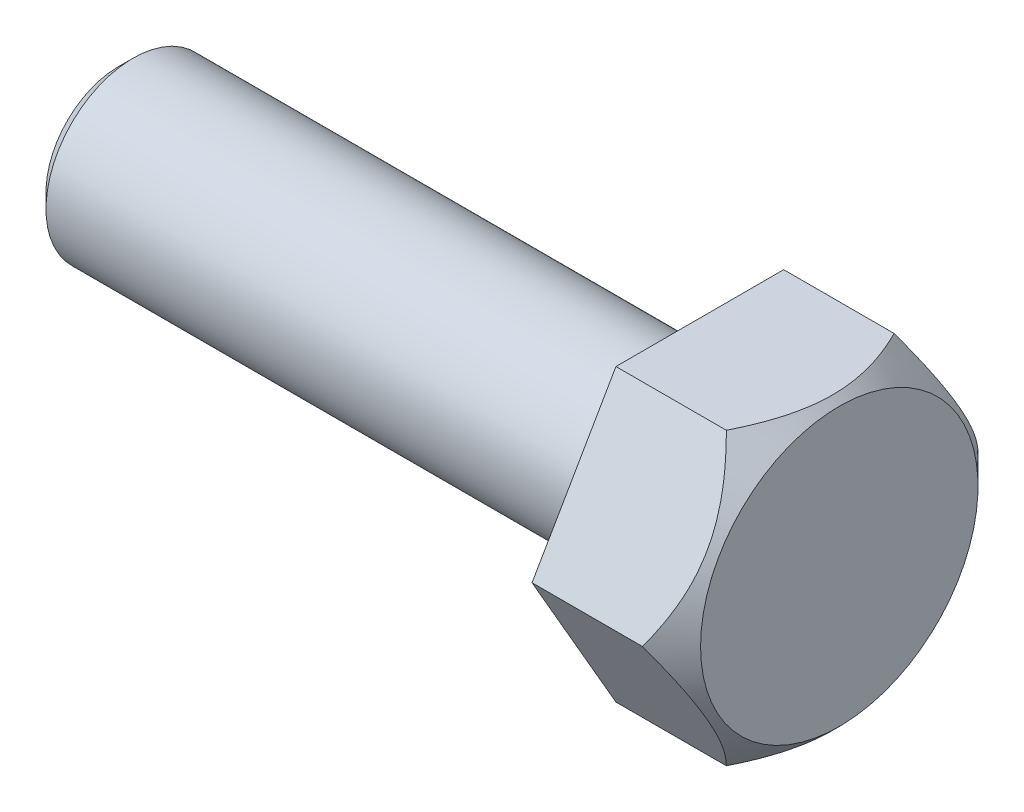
ISO-10303-21;
HEADER;
FILE_DESCRIPTION(('STEP AP214'),'2;1');
FILE_NAME('part.step','',(''),(''),'','','');
FILE_SCHEMA(('AUTOMOTIVE_DESIGN { 1 0 10303 214 1 1 1 1 }'));
ENDSEC;
DATA;
#1=APPLICATION_CONTEXT('core data for automotive mechanical design processes');
#2=APPLICATION_PROTOCOL_DEFINITION('international standard','automotive_design',2000,#1);
#3=PRODUCT_CONTEXT('',#1,'mechanical');
#4=PRODUCT('Part','Part','',(#3));
#5=PRODUCT_RELATED_PRODUCT_CATEGORY('part','',(#4));
#6=PRODUCT_DEFINITION_FORMATION('','',#4);
#7=PRODUCT_DEFINITION_CONTEXT('part definition',#1,'design');
#8=PRODUCT_DEFINITION('design','',#6,#7);
#9=PRODUCT_DEFINITION_SHAPE('','',#8);
#10=(LENGTH_UNIT() NAMED_UNIT(*) SI_UNIT(.MILLI.,.METRE.));
#11=(NAMED_UNIT(*) PLANE_ANGLE_UNIT() SI_UNIT($,.RADIAN.));
#12=(NAMED_UNIT(*) SI_UNIT($,.STERADIAN.) SOLID_ANGLE_UNIT());
#13=UNCERTAINTY_MEASURE_WITH_UNIT(LENGTH_MEASURE(1.E-05),#10,'distance_accuracy_value','');
#14=(GEOMETRIC_REPRESENTATION_CONTEXT(3) GLOBAL_UNCERTAINTY_ASSIGNED_CONTEXT((#13)) GLOBAL_UNIT_ASSIGNED_CONTEXT((#10,
#11,#12)) REPRESENTATION_CONTEXT('',''));
#15=CARTESIAN_POINT('',(0.,0.,0.));
#16=DIRECTION('',(0.,0.,1.));
#17=DIRECTION('',(1.,0.,0.));
#18=AXIS2_PLACEMENT_3D('',#15,#16,#17);
#19=CARTESIAN_POINT('',(4.80000000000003,4.99999999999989,2.88675134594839));
#20=DIRECTION('',(0.,-0.500000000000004,-0.866025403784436));
#21=DIRECTION('',(0.,0.866025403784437,-0.500000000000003));
#22=AXIS2_PLACEMENT_3D('',#19,#20,#21);
#23=PLANE('',#22);
#24=CARTESIAN_POINT('',(3.79988452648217,5.00019999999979,2.88663587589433));
#25=CARTESIAN_POINT('',(3.84951645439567,4.91422723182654,2.93627227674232));
#26=CARTESIAN_POINT('',(3.89762527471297,4.82759363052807,2.98629020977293));
#27=CARTESIAN_POINT('',(3.99033336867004,4.65287511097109,3.08716399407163));
#28=CARTESIAN_POINT('',(4.03493072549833,4.56478943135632,3.13802028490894));
#29=CARTESIAN_POINT('',(4.16314092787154,4.29734143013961,3.29243146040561));
#30=CARTESIAN_POINT('',(4.24062493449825,4.11571500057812,3.39729352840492));
#31=CARTESIAN_POINT('',(4.37331105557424,3.74945075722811,3.60875628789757));
#32=CARTESIAN_POINT('',(4.42884745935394,3.56490656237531,3.71530292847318));
#33=CARTESIAN_POINT('',(4.49308950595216,3.28505622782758,3.87687459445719));
#34=CARTESIAN_POINT('',(4.51131783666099,3.19136076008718,3.930969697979));
#35=CARTESIAN_POINT('',(4.54100781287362,3.00317647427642,4.03961794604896));
#36=CARTESIAN_POINT('',(4.55247046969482,2.90868777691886,4.09417102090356));
#37=CARTESIAN_POINT('',(4.57168913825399,2.67843374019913,4.2271082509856));
#38=CARTESIAN_POINT('',(4.57572171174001,2.54242031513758,4.30563563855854));
#39=CARTESIAN_POINT('',(4.56895414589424,2.27063858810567,4.46254889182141));
#40=CARTESIAN_POINT('',(4.55814880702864,2.13487038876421,4.54093469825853));
#41=CARTESIAN_POINT('',(4.52234235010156,1.86461396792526,4.69696731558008));
#42=CARTESIAN_POINT('',(4.49732535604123,1.73012734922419,4.77461320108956));
#43=CARTESIAN_POINT('',(4.43445567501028,1.46346560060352,4.92857043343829));
#44=CARTESIAN_POINT('',(4.39660397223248,1.33129029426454,5.00488188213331));
#45=CARTESIAN_POINT('',(4.31873011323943,1.09665179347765,5.14035048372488));
#46=CARTESIAN_POINT('',(4.28075574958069,0.993669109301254,5.199807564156));
#47=CARTESIAN_POINT('',(4.19868737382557,0.789552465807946,5.31765436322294));
#48=CARTESIAN_POINT('',(4.15459317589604,0.688418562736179,5.37604404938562));
#49=CARTESIAN_POINT('',(4.06127361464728,0.488318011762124,5.4915721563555));
#50=CARTESIAN_POINT('',(4.01206438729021,0.389345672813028,5.54871386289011));
#51=CARTESIAN_POINT('',(3.90916087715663,0.193233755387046,5.66193913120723));
#52=CARTESIAN_POINT('',(3.85546934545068,0.0960930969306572,5.71802331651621));
#53=CARTESIAN_POINT('',(3.79988452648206,-0.000200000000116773,5.7736181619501));
#54=B_SPLINE_CURVE_WITH_KNOTS('',3,(#24,#25,#26,#27,#28,#29,#30,#31,#32,#33,#34,#35,#36,#37,#38,
#39,#40,#41,#42,#43,#44,#45,#46,#47,#48,#49,#50,#51,#52,#53),.UNSPECIFIED.,.F.,.F.,(4,2,2,2,2,2,
2,2,2,2,2,2,2,2,4),(0.,0.332945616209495,0.666071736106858,1.3359206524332,1.99513262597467,
2.32409207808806,2.65300234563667,3.12358963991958,3.59434188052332,4.06562104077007,
4.53686407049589,4.9111795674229,5.28550643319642,5.65868635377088,6.0316388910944),.UNSPECIFIED.);
#55=CARTESIAN_POINT('',(3.80000000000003,4.99999999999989,2.88675134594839));
#56=VERTEX_POINT('',#55);
#57=CARTESIAN_POINT('',(3.80000000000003,0.,5.77350269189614));
#58=VERTEX_POINT('',#57);
#59=EDGE_CURVE('E166',#56,#58,#54,.T.);
#60=ORIENTED_EDGE('',*,*,#59,.F.);
#61=DIRECTION('',(-1.,0.,0.));
#62=VECTOR('',#61,1.);
#63=CARTESIAN_POINT('',(4.80000000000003,4.99999999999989,2.88675134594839));
#64=LINE('',#63,#62);
#65=CARTESIAN_POINT('',(0.,4.99999999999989,2.88675134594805));
#66=VERTEX_POINT('',#65);
#67=EDGE_CURVE('E118',#56,#66,#64,.T.);
#68=ORIENTED_EDGE('',*,*,#67,.T.);
#69=DIRECTION('',(0.,-0.866025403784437,0.500000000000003));
#70=VECTOR('',#69,1.);
#71=CARTESIAN_POINT('',(0.,4.99999999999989,2.88675134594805));
#72=LINE('',#71,#70);
#73=CARTESIAN_POINT('',(0.,0.,5.77350269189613));
#74=VERTEX_POINT('',#73);
#75=EDGE_CURVE('E121',#66,#74,#72,.T.);
#76=ORIENTED_EDGE('',*,*,#75,.T.);
#77=DIRECTION('',(-1.,0.,0.));
#78=VECTOR('',#77,1.);
#79=CARTESIAN_POINT('',(4.80000000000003,0.,5.77350269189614));
#80=LINE('',#79,#78);
#81=EDGE_CURVE('E64',#58,#74,#80,.T.);
#82=ORIENTED_EDGE('',*,*,#81,.F.);
#83=EDGE_LOOP('',(#60,#68,#76,#82));
#84=FACE_BOUND('',#83,.T.);
#85=ADVANCED_FACE('F40',(#84),#23,.F.);
#86=CARTESIAN_POINT('',(4.80000000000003,0.,5.77350269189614));
#87=DIRECTION('',(0.,0.499999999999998,-0.866025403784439));
#88=DIRECTION('',(0.,0.86602540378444,0.499999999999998));
#89=AXIS2_PLACEMENT_3D('',#86,#87,#88);
#90=PLANE('',#89);
#91=CARTESIAN_POINT('',(3.79988452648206,0.000199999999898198,5.7736181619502));
#92=CARTESIAN_POINT('',(3.84951645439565,-0.0857727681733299,5.72398176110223));
#93=CARTESIAN_POINT('',(3.897625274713,-0.172406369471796,5.67396382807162));
#94=CARTESIAN_POINT('',(3.99033336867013,-0.347124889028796,5.57309004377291));
#95=CARTESIAN_POINT('',(4.03493072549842,-0.435210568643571,5.52223375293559));
#96=CARTESIAN_POINT('',(4.16314092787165,-0.702658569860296,5.36782257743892));
#97=CARTESIAN_POINT('',(4.24062493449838,-0.884284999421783,5.26296050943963));
#98=CARTESIAN_POINT('',(4.37331105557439,-1.25054924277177,5.05149774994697));
#99=CARTESIAN_POINT('',(4.42884745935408,-1.43509343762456,4.94495110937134));
#100=CARTESIAN_POINT('',(4.4930895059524,-1.71494377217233,4.78337944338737));
#101=CARTESIAN_POINT('',(4.51131783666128,-1.80863923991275,4.72928433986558));
#102=CARTESIAN_POINT('',(4.5410078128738,-1.9968235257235,4.62063609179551));
#103=CARTESIAN_POINT('',(4.55247046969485,-2.09131222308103,4.56608301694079));
#104=CARTESIAN_POINT('',(4.57168913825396,-2.32156625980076,4.43314578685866));
#105=CARTESIAN_POINT('',(4.57572171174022,-2.45757968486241,4.35461839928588));
#106=CARTESIAN_POINT('',(4.56895414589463,-2.72936141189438,4.19770514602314));
#107=CARTESIAN_POINT('',(4.55814880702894,-2.86512961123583,4.11931933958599));
#108=CARTESIAN_POINT('',(4.5223423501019,-3.13538603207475,3.96328672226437));
#109=CARTESIAN_POINT('',(4.49732535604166,-3.26987265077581,3.88564083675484));
#110=CARTESIAN_POINT('',(4.43445567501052,-3.53653439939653,3.73168360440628));
#111=CARTESIAN_POINT('',(4.39660397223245,-3.66870970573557,3.65537215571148));
#112=CARTESIAN_POINT('',(4.31873011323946,-3.90334820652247,3.51990355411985));
#113=CARTESIAN_POINT('',(4.28075574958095,-4.00633089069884,3.46044647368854));
#114=CARTESIAN_POINT('',(4.198687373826,-4.21044753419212,3.34259967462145));
#115=CARTESIAN_POINT('',(4.15459317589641,-4.31158143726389,3.28420998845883));
#116=CARTESIAN_POINT('',(4.06127361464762,-4.51168198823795,3.168681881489));
#117=CARTESIAN_POINT('',(4.0120643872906,-4.61065432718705,3.11154017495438));
#118=CARTESIAN_POINT('',(3.90916087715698,-4.80676624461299,2.99831490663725));
#119=CARTESIAN_POINT('',(3.85546934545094,-4.90390690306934,2.94223072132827));
#120=CARTESIAN_POINT('',(3.79988452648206,-5.00020000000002,2.88663587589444));
#121=B_SPLINE_CURVE_WITH_KNOTS('',3,(#91,#92,#93,#94,#95,#96,#97,#98,#99,#100,#101,#102,#103,
#104,#105,#106,#107,#108,#109,#110,#111,#112,#113,#114,#115,#116,#117,#118,#119,#120),
.UNSPECIFIED.,.F.,.F.,(4,2,2,2,2,2,2,2,2,2,2,2,2,2,4),(0.,0.332945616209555,0.666071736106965,
1.3359206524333,1.99513262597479,2.32409207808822,2.65300234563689,3.12358963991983,
3.59434188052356,4.06562104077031,4.53686407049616,4.91117956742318,5.28550643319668,
5.65868635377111,6.03163889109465),.UNSPECIFIED.);
#122=CARTESIAN_POINT('',(3.80000000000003,-5.00000000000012,2.88675134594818));
#123=VERTEX_POINT('',#122);
#124=EDGE_CURVE('E173',#58,#123,#121,.T.);
#125=ORIENTED_EDGE('',*,*,#124,.F.);
#126=ORIENTED_EDGE('',*,*,#81,.T.);
#127=DIRECTION('',(0.,-0.866025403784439,-0.499999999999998));
#128=VECTOR('',#127,1.);
#129=CARTESIAN_POINT('',(0.,0.,5.77350269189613));
#130=LINE('',#129,#128);
#131=CARTESIAN_POINT('',(0.,-5.00000000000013,2.88675134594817));
#132=VERTEX_POINT('',#131);
#133=EDGE_CURVE('E106',#74,#132,#130,.T.);
#134=ORIENTED_EDGE('',*,*,#133,.T.);
#135=DIRECTION('',(-1.,0.,0.));
#136=VECTOR('',#135,1.);
#137=CARTESIAN_POINT('',(4.80000000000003,-5.00000000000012,2.88675134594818));
#138=LINE('',#137,#136);
#139=EDGE_CURVE('E97',#123,#132,#138,.T.);
#140=ORIENTED_EDGE('',*,*,#139,.F.);
#141=EDGE_LOOP('',(#125,#126,#134,#140));
#142=FACE_BOUND('',#141,.T.);
#143=ADVANCED_FACE('F151',(#142),#90,.F.);
#144=CARTESIAN_POINT('',(4.80000000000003,-5.00000000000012,2.88675134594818));
#145=DIRECTION('',(0.,1.,0.));
#146=DIRECTION('',(0.,0.,1.));
#147=AXIS2_PLACEMENT_3D('',#144,#145,#146);
#148=PLANE('',#147);
#149=CARTESIAN_POINT('',(1.81432336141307,-4.9999999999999,-5.93336867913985));
#150=CARTESIAN_POINT('',(1.92418858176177,-5.00000000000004,-5.78966341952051));
#151=CARTESIAN_POINT('',(2.03304389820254,-5.0000000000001,-5.64517359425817));
#152=CARTESIAN_POINT('',(2.24827641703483,-5.00000000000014,-5.35430787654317));
#153=CARTESIAN_POINT('',(2.35465301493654,-5.00000000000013,-5.20793153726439));
#154=CARTESIAN_POINT('',(2.56522692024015,-5.00000000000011,-4.91190536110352));
#155=CARTESIAN_POINT('',(2.66940102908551,-5.00000000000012,-4.76223896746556));
#156=CARTESIAN_POINT('',(2.87403749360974,-5.00000000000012,-4.4603979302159));
#157=CARTESIAN_POINT('',(2.97450010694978,-5.00000000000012,-4.30822346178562));
#158=CARTESIAN_POINT('',(3.17689028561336,-5.00000000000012,-3.99153933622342));
#159=CARTESIAN_POINT('',(3.27853053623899,-5.00000000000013,-3.82684512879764));
#160=CARTESIAN_POINT('',(3.47537782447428,-5.00000000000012,-3.49359569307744));
#161=CARTESIAN_POINT('',(3.5705838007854,-5.0000000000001,-3.32503983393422));
#162=CARTESIAN_POINT('',(3.75252582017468,-5.00000000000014,-2.98404180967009));
#163=CARTESIAN_POINT('',(3.83928674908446,-5.00000000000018,-2.81161302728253));
#164=CARTESIAN_POINT('',(4.00239520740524,-5.00000000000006,-2.4619377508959));
#165=CARTESIAN_POINT('',(4.07874758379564,-4.99999999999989,-2.28469354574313));
#166=CARTESIAN_POINT('',(4.21181755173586,-4.99999999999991,-1.94171568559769));
#167=CARTESIAN_POINT('',(4.26969922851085,-5.00000000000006,-1.77643834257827));
#168=CARTESIAN_POINT('',(4.37222452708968,-5.00000000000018,-1.44175059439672));
#169=CARTESIAN_POINT('',(4.41686728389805,-5.00000000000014,-1.27233991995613));
#170=CARTESIAN_POINT('',(4.48978435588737,-5.00000000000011,-0.933301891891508));
#171=CARTESIAN_POINT('',(4.51835018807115,-5.00000000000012,-0.763738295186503));
#172=CARTESIAN_POINT('',(4.55853073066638,-5.00000000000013,-0.422603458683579));
#173=CARTESIAN_POINT('',(4.57014874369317,-5.00000000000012,-0.251032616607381));
#174=CARTESIAN_POINT('',(4.57548648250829,-5.00000000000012,0.0853406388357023));
#175=CARTESIAN_POINT('',(4.56992113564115,-5.00000000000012,0.250131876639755));
#176=CARTESIAN_POINT('',(4.54282076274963,-5.00000000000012,0.578387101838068));
#177=CARTESIAN_POINT('',(4.52128424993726,-5.00000000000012,0.741850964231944));
#178=CARTESIAN_POINT('',(4.46307865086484,-5.00000000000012,1.06903592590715));
#179=CARTESIAN_POINT('',(4.42614570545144,-5.00000000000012,1.23270929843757));
#180=CARTESIAN_POINT('',(4.33916921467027,-5.00000000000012,1.55646565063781));
#181=CARTESIAN_POINT('',(4.28912653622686,-5.00000000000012,1.71654886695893));
#182=CARTESIAN_POINT('',(4.17425220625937,-5.00000000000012,2.04376834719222));
#183=CARTESIAN_POINT('',(4.10863700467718,-5.00000000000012,2.2106265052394));
#184=CARTESIAN_POINT('',(3.96728810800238,-5.00000000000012,2.54003854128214));
#185=CARTESIAN_POINT('',(3.89154980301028,-5.00000000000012,2.70259041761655));
#186=CARTESIAN_POINT('',(3.73175240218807,-5.00000000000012,3.02416565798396));
#187=CARTESIAN_POINT('',(3.6476675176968,-5.00000000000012,3.18317610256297));
#188=CARTESIAN_POINT('',(3.47302987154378,-5.00000000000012,3.49754870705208));
#189=CARTESIAN_POINT('',(3.38247811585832,-5.00000000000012,3.65291142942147));
#190=CARTESIAN_POINT('',(3.20078159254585,-5.00000000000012,3.95285892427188));
#191=CARTESIAN_POINT('',(3.10988790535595,-5.00000000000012,4.09759659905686));
#192=CARTESIAN_POINT('',(2.92424528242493,-5.00000000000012,4.38458573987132));
#193=CARTESIAN_POINT('',(2.82949605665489,-5.00000000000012,4.52683701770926));
#194=CARTESIAN_POINT('',(2.63760520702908,-5.00000000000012,4.80803186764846));
#195=CARTESIAN_POINT('',(2.54048901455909,-5.00000000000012,4.94699285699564));
#196=CARTESIAN_POINT('',(2.34366358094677,-5.00000000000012,5.22301057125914));
#197=CARTESIAN_POINT('',(2.24395506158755,-5.00000000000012,5.36006781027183));
#198=CARTESIAN_POINT('',(2.1431858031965,-5.00000000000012,5.49632687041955));
#199=B_SPLINE_CURVE_WITH_KNOTS('',3,(#149,#150,#151,#152,#153,#154,#155,#156,#157,#158,#159,
#160,#161,#162,#163,#164,#165,#166,#167,#168,#169,#170,#171,#172,#173,#174,#175,#176,#177,#178,
#179,#180,#181,#182,#183,#184,#185,#186,#187,#188,#189,#190,#191,#192,#193,#194,#195,#196,#197,
#198),.UNSPECIFIED.,.F.,.F.,(4,2,2,2,2,2,2,2,2,2,2,2,2,2,2,2,2,2,2,2,2,2,2,2,4),(0.,
0.542683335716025,1.08549766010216,1.63250741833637,2.17947913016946,2.75996048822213,
3.34053736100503,3.91934802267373,4.49788822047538,5.02279153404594,5.54772913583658,
6.06281331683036,6.57779711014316,7.07164749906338,7.56554386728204,8.0682770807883,
8.57097705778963,9.10845041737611,9.64616937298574,10.1856047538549,10.7249564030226,
11.2376185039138,11.7503192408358,12.2588884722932,12.7673175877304),.UNSPECIFIED.);
#200=CARTESIAN_POINT('',(3.80000000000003,-4.99999999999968,-2.88675134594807));
#201=VERTEX_POINT('',#200);
#202=EDGE_CURVE('E200',#123,#201,#199,.F.);
#203=ORIENTED_EDGE('',*,*,#202,.F.);
#204=ORIENTED_EDGE('',*,*,#139,.T.);
#205=DIRECTION('',(0.,0.,-1.));
#206=VECTOR('',#205,1.);
#207=CARTESIAN_POINT('',(0.,-5.00000000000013,2.88675134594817));
#208=LINE('',#207,#206);
#209=CARTESIAN_POINT('',(0.,-4.99999999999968,-2.88675134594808));
#210=VERTEX_POINT('',#209);
#211=EDGE_CURVE('E101',#132,#210,#208,.T.);
#212=ORIENTED_EDGE('',*,*,#211,.T.);
#213=DIRECTION('',(-1.,0.,0.));
#214=VECTOR('',#213,1.);
#215=CARTESIAN_POINT('',(4.80000000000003,-4.99999999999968,-2.88675134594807));
#216=LINE('',#215,#214);
#217=EDGE_CURVE('E86',#201,#210,#216,.T.);
#218=ORIENTED_EDGE('',*,*,#217,.F.);
#219=EDGE_LOOP('',(#203,#204,#212,#218));
#220=FACE_BOUND('',#219,.T.);
#221=ADVANCED_FACE('F102',(#220),#148,.F.);
#222=CARTESIAN_POINT('',(4.80000000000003,2.25514051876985E-13,-5.77350269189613));
#223=DIRECTION('',(0.,-0.500000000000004,-0.866025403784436));
#224=DIRECTION('',(0.,0.866025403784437,-0.500000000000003));
#225=AXIS2_PLACEMENT_3D('',#222,#223,#224);
#226=PLANE('',#225);
#227=DIRECTION('',(-1.,0.,0.));
#228=VECTOR('',#227,1.);
#229=CARTESIAN_POINT('',(4.80000000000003,2.25514051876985E-13,-5.77350269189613));
#230=LINE('',#229,#228);
#231=CARTESIAN_POINT('',(3.80000000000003,2.25514051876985E-13,-5.77350269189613));
#232=VERTEX_POINT('',#231);
#233=CARTESIAN_POINT('',(0.,2.22044604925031E-13,-5.77350269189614));
#234=VERTEX_POINT('',#233);
#235=EDGE_CURVE('E98',#232,#234,#230,.T.);
#236=ORIENTED_EDGE('',*,*,#235,.F.);
#237=CARTESIAN_POINT('',(3.79988452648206,0.000200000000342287,-5.7736181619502));
#238=CARTESIAN_POINT('',(3.84951645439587,-0.0857727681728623,-5.72398176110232));
#239=CARTESIAN_POINT('',(3.89762527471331,-0.172406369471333,-5.67396382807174));
#240=CARTESIAN_POINT('',(3.99033336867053,-0.347124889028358,-5.57309004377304));
#241=CARTESIAN_POINT('',(4.03493072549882,-0.435210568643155,-5.5222337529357));
#242=CARTESIAN_POINT('',(4.16314092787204,-0.702658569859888,-5.367822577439));
#243=CARTESIAN_POINT('',(4.24062493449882,-0.88428499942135,-5.26296050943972));
#244=CARTESIAN_POINT('',(4.37331105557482,-1.25054924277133,-5.05149774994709));
#245=CARTESIAN_POINT('',(4.42884745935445,-1.43509343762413,-4.94495110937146));
#246=CARTESIAN_POINT('',(4.49308950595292,-1.71494377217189,-4.78337944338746));
#247=CARTESIAN_POINT('',(4.5113178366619,-1.80863923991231,-4.72928433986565));
#248=CARTESIAN_POINT('',(4.54100781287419,-1.99682352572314,-4.6206360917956));
#249=CARTESIAN_POINT('',(4.55247046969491,-2.09131222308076,-4.56608301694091));
#250=CARTESIAN_POINT('',(4.57168913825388,-2.32156625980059,-4.43314578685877));
#251=CARTESIAN_POINT('',(4.5757217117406,-2.45757968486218,-4.3546183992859));
#252=CARTESIAN_POINT('',(4.56895414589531,-2.72936141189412,-4.19770514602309));
#253=CARTESIAN_POINT('',(4.55814880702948,-2.86512961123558,-4.11931933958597));
#254=CARTESIAN_POINT('',(4.52234235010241,-3.13538603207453,-3.96328672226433));
#255=CARTESIAN_POINT('',(4.49732535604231,-3.26987265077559,-3.88564083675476));
#256=CARTESIAN_POINT('',(4.4344556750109,-3.5365343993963,-3.73168360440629));
#257=CARTESIAN_POINT('',(4.39660397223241,-3.66870970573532,-3.65537215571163));
#258=CARTESIAN_POINT('',(4.3187301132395,-3.90334820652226,-3.51990355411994));
#259=CARTESIAN_POINT('',(4.2807557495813,-4.00633089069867,-3.4604464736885));
#260=CARTESIAN_POINT('',(4.19868737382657,-4.21044753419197,-3.34259967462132));
#261=CARTESIAN_POINT('',(4.15459317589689,-4.31158143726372,-3.28420998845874));
#262=CARTESIAN_POINT('',(4.06127361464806,-4.51168198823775,-3.16868188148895));
#263=CARTESIAN_POINT('',(4.01206438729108,-4.61065432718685,-3.11154017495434));
#264=CARTESIAN_POINT('',(3.90916087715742,-4.80676624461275,-2.99831490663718));
#265=CARTESIAN_POINT('',(3.85546934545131,-4.90390690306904,-2.94223072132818));
#266=CARTESIAN_POINT('',(3.79988452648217,-5.00019999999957,-2.88663587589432));
#267=B_SPLINE_CURVE_WITH_KNOTS('',3,(#237,#238,#239,#240,#241,#242,#243,#244,#245,#246,#247,
#248,#249,#250,#251,#252,#253,#254,#255,#256,#257,#258,#259,#260,#261,#262,#263,#264,#265,#266),
.UNSPECIFIED.,.F.,.F.,(4,2,2,2,2,2,2,2,2,2,2,2,2,2,4),(0.,0.332945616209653,0.666071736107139,
1.33592065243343,1.99513262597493,2.32409207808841,2.65300234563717,3.12358963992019,
3.59434188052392,4.06562104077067,4.53686407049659,4.91117956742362,5.28550643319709,
5.65868635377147,6.03163889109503),.UNSPECIFIED.);
#268=EDGE_CURVE('E94',#232,#201,#267,.T.);
#269=ORIENTED_EDGE('',*,*,#268,.T.);
#270=ORIENTED_EDGE('',*,*,#217,.T.);
#271=DIRECTION('',(0.,-0.866025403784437,0.500000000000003));
#272=VECTOR('',#271,1.);
#273=CARTESIAN_POINT('',(0.,2.22044604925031E-13,-5.77350269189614));
#274=LINE('',#273,#272);
#275=EDGE_CURVE('E91',#234,#210,#274,.T.);
#276=ORIENTED_EDGE('',*,*,#275,.F.);
#277=EDGE_LOOP('',(#236,#269,#270,#276));
#278=FACE_BOUND('',#277,.T.);
#279=ADVANCED_FACE('F89',(#278),#226,.T.);
#280=CARTESIAN_POINT('',(4.80000000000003,5.00000000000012,-2.88675134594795));
#281=DIRECTION('',(0.,0.499999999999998,-0.866025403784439));
#282=DIRECTION('',(0.,0.86602540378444,0.499999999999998));
#283=AXIS2_PLACEMENT_3D('',#280,#281,#282);
#284=PLANE('',#283);
#285=DIRECTION('',(-1.,0.,0.));
#286=VECTOR('',#285,1.);
#287=CARTESIAN_POINT('',(4.80000000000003,5.00000000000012,-2.88675134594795));
#288=LINE('',#287,#286);
#289=CARTESIAN_POINT('',(3.80000000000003,5.00000000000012,-2.88675134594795));
#290=VERTEX_POINT('',#289);
#291=CARTESIAN_POINT('',(0.,5.00000000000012,-2.88675134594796));
#292=VERTEX_POINT('',#291);
#293=EDGE_CURVE('E120',#290,#292,#288,.T.);
#294=ORIENTED_EDGE('',*,*,#293,.F.);
#295=CARTESIAN_POINT('',(3.79988452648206,5.00020000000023,-2.8866358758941));
#296=CARTESIAN_POINT('',(3.84951645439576,4.91422723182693,-2.9362722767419));
#297=CARTESIAN_POINT('',(3.89762527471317,4.82759363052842,-2.98629020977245));
#298=CARTESIAN_POINT('',(3.99033336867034,4.65287511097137,-3.08716399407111));
#299=CARTESIAN_POINT('',(4.03493072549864,4.56478943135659,-3.13802028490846));
#300=CARTESIAN_POINT('',(4.16314092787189,4.29734143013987,-3.29243146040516));
#301=CARTESIAN_POINT('',(4.24062493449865,4.11571500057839,-3.39729352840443));
#302=CARTESIAN_POINT('',(4.37331105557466,3.74945075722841,-3.60875628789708));
#303=CARTESIAN_POINT('',(4.42884745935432,3.56490656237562,-3.71530292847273));
#304=CARTESIAN_POINT('',(4.49308950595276,3.28505622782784,-3.87687459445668));
#305=CARTESIAN_POINT('',(4.51131783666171,3.19136076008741,-3.93096969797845));
#306=CARTESIAN_POINT('',(4.54100781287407,3.00317647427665,-4.03961794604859));
#307=CARTESIAN_POINT('',(4.55247046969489,2.90868777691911,-4.09417102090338));
#308=CARTESIAN_POINT('',(4.5716891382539,2.67843374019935,-4.22710825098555));
#309=CARTESIAN_POINT('',(4.5757217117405,2.54242031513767,-4.30563563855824));
#310=CARTESIAN_POINT('',(4.56895414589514,2.27063858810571,-4.46254889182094));
#311=CARTESIAN_POINT('',(4.55814880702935,2.13487038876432,-4.54093469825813));
#312=CARTESIAN_POINT('',(4.52234235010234,1.86461396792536,-4.69696731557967));
#313=CARTESIAN_POINT('',(4.49732535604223,1.73012734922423,-4.77461320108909));
#314=CARTESIAN_POINT('',(4.43445567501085,1.46346560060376,-4.92857043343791));
#315=CARTESIAN_POINT('',(4.3966039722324,1.33129029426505,-5.00488188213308));
#316=CARTESIAN_POINT('',(4.31873011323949,1.09665179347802,-5.14035048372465));
#317=CARTESIAN_POINT('',(4.28075574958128,0.993669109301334,-5.19980756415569));
#318=CARTESIAN_POINT('',(4.19868737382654,0.789552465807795,-5.31765436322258));
#319=CARTESIAN_POINT('',(4.15459317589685,0.688418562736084,-5.3760440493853));
#320=CARTESIAN_POINT('',(4.061273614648,0.488318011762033,-5.49157215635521));
#321=CARTESIAN_POINT('',(4.012064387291,0.389345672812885,-5.54871386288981));
#322=CARTESIAN_POINT('',(3.90916087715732,0.193233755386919,-5.66193913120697));
#323=CARTESIAN_POINT('',(3.8554693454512,0.0960930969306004,-5.71802331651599));
#324=CARTESIAN_POINT('',(3.79988452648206,-0.000199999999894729,-5.77361816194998));
#325=B_SPLINE_CURVE_WITH_KNOTS('',3,(#295,#296,#297,#298,#299,#300,#301,#302,#303,#304,#305,
#306,#307,#308,#309,#310,#311,#312,#313,#314,#315,#316,#317,#318,#319,#320,#321,#322,#323,#324),
.UNSPECIFIED.,.F.,.F.,(4,2,2,2,2,2,2,2,2,2,2,2,2,2,4),(0.,0.332945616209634,0.666071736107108,
1.33592065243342,1.99513262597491,2.32409207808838,2.65300234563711,3.12358963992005,
3.59434188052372,4.06562104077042,4.53686407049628,4.91117956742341,5.28550643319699,
5.65868635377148,6.03163889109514),.UNSPECIFIED.);
#326=EDGE_CURVE('E55',#290,#232,#325,.T.);
#327=ORIENTED_EDGE('',*,*,#326,.T.);
#328=ORIENTED_EDGE('',*,*,#235,.T.);
#329=DIRECTION('',(0.,-0.866025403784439,-0.499999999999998));
#330=VECTOR('',#329,1.);
#331=CARTESIAN_POINT('',(0.,5.00000000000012,-2.88675134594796));
#332=LINE('',#331,#330);
#333=EDGE_CURVE('E112',#292,#234,#332,.T.);
#334=ORIENTED_EDGE('',*,*,#333,.F.);
#335=EDGE_LOOP('',(#294,#327,#328,#334));
#336=FACE_BOUND('',#335,.T.);
#337=ADVANCED_FACE('F211',(#336),#284,.T.);
#338=CARTESIAN_POINT('',(4.80000000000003,4.99999999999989,2.88675134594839));
#339=DIRECTION('',(0.,1.,0.));
#340=DIRECTION('',(0.,0.,1.));
#341=AXIS2_PLACEMENT_3D('',#338,#339,#340);
#342=PLANE('',#341);
#343=ORIENTED_EDGE('',*,*,#67,.F.);
#344=CARTESIAN_POINT('',(1.81432336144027,5.00000000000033,-5.9333686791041));
#345=CARTESIAN_POINT('',(1.92418858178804,5.00000000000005,-5.78966341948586));
#346=CARTESIAN_POINT('',(2.0330438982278,4.99999999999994,-5.64517359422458));
#347=CARTESIAN_POINT('',(2.24827641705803,4.99999999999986,-5.35430787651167));
#348=CARTESIAN_POINT('',(2.35465301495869,4.99999999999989,-5.20793153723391));
#349=CARTESIAN_POINT('',(2.56522692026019,4.99999999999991,-4.91190536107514));
#350=CARTESIAN_POINT('',(2.6694010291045,4.9999999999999,-4.76223896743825));
#351=CARTESIAN_POINT('',(2.87403749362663,4.99999999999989,-4.46039793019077));
#352=CARTESIAN_POINT('',(2.97450010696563,4.9999999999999,-4.30822346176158));
#353=CARTESIAN_POINT('',(3.17689028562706,4.99999999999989,-3.99153933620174));
#354=CARTESIAN_POINT('',(3.27853053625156,4.99999999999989,-3.82684512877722));
#355=CARTESIAN_POINT('',(3.47537782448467,4.9999999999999,-3.4935956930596));
#356=CARTESIAN_POINT('',(3.57058380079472,4.99999999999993,-3.32503983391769));
#357=CARTESIAN_POINT('',(3.75252582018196,4.99999999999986,-2.98404180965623));
#358=CARTESIAN_POINT('',(3.83928674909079,4.99999999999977,-2.81161302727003));
#359=CARTESIAN_POINT('',(4.00239520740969,5.00000000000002,-2.46193775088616));
#360=CARTESIAN_POINT('',(4.07874758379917,5.00000000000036,-2.28469354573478));
#361=CARTESIAN_POINT('',(4.21181755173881,5.00000000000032,-1.94171568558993));
#362=CARTESIAN_POINT('',(4.26969922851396,5.00000000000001,-1.77643834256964));
#363=CARTESIAN_POINT('',(4.37222452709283,4.99999999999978,-1.44175059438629));
#364=CARTESIAN_POINT('',(4.41686728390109,4.99999999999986,-1.27233991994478));
#365=CARTESIAN_POINT('',(4.48978435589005,4.99999999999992,-0.933301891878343));
#366=CARTESIAN_POINT('',(4.51835018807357,4.9999999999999,-0.76373829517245));
#367=CARTESIAN_POINT('',(4.55853073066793,4.99999999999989,-0.422603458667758));
#368=CARTESIAN_POINT('',(4.57014874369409,4.99999999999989,-0.25103261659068));
#369=CARTESIAN_POINT('',(4.57548648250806,4.99999999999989,0.0853406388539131));
#370=CARTESIAN_POINT('',(4.56992113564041,4.99999999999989,0.250131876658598));
#371=CARTESIAN_POINT('',(4.54282076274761,4.9999999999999,0.57838710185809));
#372=CARTESIAN_POINT('',(4.52128424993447,4.99999999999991,0.741850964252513));
#373=CARTESIAN_POINT('',(4.46307865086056,4.99999999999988,1.06903592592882));
#374=CARTESIAN_POINT('',(4.42614570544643,4.99999999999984,1.23270929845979));
#375=CARTESIAN_POINT('',(4.33916921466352,4.99999999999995,1.55646565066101));
#376=CARTESIAN_POINT('',(4.28912653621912,5.00000000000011,1.71654886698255));
#377=CARTESIAN_POINT('',(4.17425220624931,5.00000000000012,2.04376834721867));
#378=CARTESIAN_POINT('',(4.1086370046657,4.99999999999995,2.2106265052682));
#379=CARTESIAN_POINT('',(3.96728810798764,4.99999999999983,2.54003854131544));
#380=CARTESIAN_POINT('',(3.89154980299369,4.99999999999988,2.70259041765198));
#381=CARTESIAN_POINT('',(3.73175240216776,4.99999999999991,3.0241656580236));
#382=CARTESIAN_POINT('',(3.64766751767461,4.9999999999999,3.18317610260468));
#383=CARTESIAN_POINT('',(3.47302987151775,4.99999999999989,3.49754870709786));
#384=CARTESIAN_POINT('',(3.38247811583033,4.99999999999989,3.65291142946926));
#385=CARTESIAN_POINT('',(3.20078159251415,4.99999999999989,3.9528589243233));
#386=CARTESIAN_POINT('',(3.10988790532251,4.99999999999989,4.09759659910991));
#387=CARTESIAN_POINT('',(2.924245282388,4.99999999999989,4.38458573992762));
#388=CARTESIAN_POINT('',(2.8294960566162,4.99999999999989,4.52683701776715));
#389=CARTESIAN_POINT('',(2.63760520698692,4.99999999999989,4.80803186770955));
#390=CARTESIAN_POINT('',(2.54048901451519,4.99999999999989,4.94699285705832));
#391=CARTESIAN_POINT('',(2.34366358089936,4.99999999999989,5.22301057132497));
#392=CARTESIAN_POINT('',(2.24395506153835,4.99999999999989,5.36006781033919));
#393=CARTESIAN_POINT('',(2.14318580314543,4.99999999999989,5.49632687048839));
#394=B_SPLINE_CURVE_WITH_KNOTS('',3,(#344,#345,#346,#347,#348,#349,#350,#351,#352,#353,#354,
#355,#356,#357,#358,#359,#360,#361,#362,#363,#364,#365,#366,#367,#368,#369,#370,#371,#372,#373,
#374,#375,#376,#377,#378,#379,#380,#381,#382,#383,#384,#385,#386,#387,#388,#389,#390,#391,#392,
#393),.UNSPECIFIED.,.F.,.F.,(4,2,2,2,2,2,2,2,2,2,2,2,2,2,2,2,2,2,2,2,2,2,2,2,4),(0.,
0.542683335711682,1.08549766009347,1.63250741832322,2.17947913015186,2.75996048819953,
3.34053736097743,3.9193480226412,4.49788822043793,5.0227915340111,5.54772913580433,
6.06281331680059,6.57779711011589,7.07164749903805,7.56554386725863,8.06827708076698,
8.57097705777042,9.10845041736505,9.6461693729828,10.1856047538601,10.724956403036,
11.2376185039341,11.750319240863,12.2588884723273,12.7673175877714),.UNSPECIFIED.);
#395=EDGE_CURVE('E183',#56,#290,#394,.F.);
#396=ORIENTED_EDGE('',*,*,#395,.T.);
#397=ORIENTED_EDGE('',*,*,#293,.T.);
#398=DIRECTION('',(0.,0.,-1.));
#399=VECTOR('',#398,1.);
#400=CARTESIAN_POINT('',(0.,4.99999999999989,2.88675134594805));
#401=LINE('',#400,#399);
#402=EDGE_CURVE('E114',#66,#292,#401,.T.);
#403=ORIENTED_EDGE('',*,*,#402,.F.);
#404=EDGE_LOOP('',(#343,#396,#397,#403));
#405=FACE_BOUND('',#404,.T.);
#406=ADVANCED_FACE('F162',(#405),#342,.T.);
#407=CARTESIAN_POINT('',(0.,0.,5.77350269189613));
#408=DIRECTION('',(1.,0.,0.));
#409=DIRECTION('',(0.,0.,-1.));
#410=AXIS2_PLACEMENT_3D('',#407,#408,#409);
#411=PLANE('',#410);
#412=CARTESIAN_POINT('',(0.,2.18575157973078E-13,-1.17961196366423E-13));
#413=DIRECTION('',(1.,0.,0.));
#414=DIRECTION('',(0.,0.,-1.));
#415=AXIS2_PLACEMENT_3D('',#412,#413,#414);
#416=CIRCLE('',#415,3.);
#417=CARTESIAN_POINT('',(0.,2.17242890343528E-13,-3.00000000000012));
#418=VERTEX_POINT('',#417);
#419=EDGE_CURVE('E126',#418,#418,#416,.T.);
#420=ORIENTED_EDGE('',*,*,#419,.T.);
#421=EDGE_LOOP('',(#420));
#422=FACE_BOUND('',#421,.T.);
#423=ORIENTED_EDGE('',*,*,#75,.F.);
#424=ORIENTED_EDGE('',*,*,#402,.T.);
#425=ORIENTED_EDGE('',*,*,#333,.T.);
#426=ORIENTED_EDGE('',*,*,#275,.T.);
#427=ORIENTED_EDGE('',*,*,#211,.F.);
#428=ORIENTED_EDGE('',*,*,#133,.F.);
#429=EDGE_LOOP('',(#423,#424,#425,#426,#427,#428));
#430=FACE_BOUND('',#429,.T.);
#431=ADVANCED_FACE('F109',(#422,#430),#411,.F.);
#432=CARTESIAN_POINT('',(-20.,2.1163626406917E-13,-1.17961196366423E-13));
#433=DIRECTION('',(1.,0.,0.));
#434=DIRECTION('',(0.,0.,-1.));
#435=AXIS2_PLACEMENT_3D('',#432,#433,#434);
#436=CYLINDRICAL_SURFACE('',#435,3.);
#437=CARTESIAN_POINT('',(-19.5,2.1163626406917E-13,-1.17961196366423E-13));
#438=DIRECTION('',(1.,0.,0.));
#439=DIRECTION('',(0.,0.,-1.));
#440=AXIS2_PLACEMENT_3D('',#437,#438,#439);
#441=CIRCLE('',#440,3.);
#442=CARTESIAN_POINT('',(-19.5,2.1030399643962E-13,-3.00000000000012));
#443=VERTEX_POINT('',#442);
#444=EDGE_CURVE('E48',#443,#443,#441,.T.);
#445=ORIENTED_EDGE('',*,*,#444,.T.);
#446=EDGE_LOOP('',(#445));
#447=FACE_BOUND('',#446,.T.);
#448=ORIENTED_EDGE('',*,*,#419,.F.);
#449=EDGE_LOOP('',(#448));
#450=FACE_BOUND('',#449,.T.);
#451=ADVANCED_FACE('F42',(#447,#450),#436,.T.);
#452=CARTESIAN_POINT('',(-20.,2.1163626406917E-13,-1.17961196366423E-13));
#453=DIRECTION('',(1.,0.,0.));
#454=DIRECTION('',(0.,0.,-1.));
#455=AXIS2_PLACEMENT_3D('',#452,#453,#454);
#456=PLANE('',#455);
#457=CARTESIAN_POINT('',(-20.,2.1163626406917E-13,-1.17961196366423E-13));
#458=DIRECTION('',(1.,0.,0.));
#459=DIRECTION('',(0.,0.,-1.));
#460=AXIS2_PLACEMENT_3D('',#457,#458,#459);
#461=CIRCLE('',#460,2.5);
#462=CARTESIAN_POINT('',(-20.,2.10526041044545E-13,-2.50000000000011));
#463=VERTEX_POINT('',#462);
#464=EDGE_CURVE('E11',#463,#463,#461,.F.);
#465=ORIENTED_EDGE('',*,*,#464,.T.);
#466=EDGE_LOOP('',(#465));
#467=FACE_BOUND('',#466,.T.);
#468=ADVANCED_FACE('F136',(#467),#456,.F.);
#469=CARTESIAN_POINT('',(-19.5,2.1163626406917E-13,-1.17961196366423E-13));
#470=DIRECTION('',(1.,0.,0.));
#471=DIRECTION('',(0.,0.,-1.));
#472=AXIS2_PLACEMENT_3D('',#469,#470,#471);
#473=CONICAL_SURFACE('',#472,3.,0.785398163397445);
#474=ORIENTED_EDGE('',*,*,#464,.F.);
#475=EDGE_LOOP('',(#474));
#476=FACE_BOUND('',#475,.T.);
#477=ORIENTED_EDGE('',*,*,#444,.F.);
#478=EDGE_LOOP('',(#477));
#479=FACE_BOUND('',#478,.T.);
#480=ADVANCED_FACE('F133',(#476,#479),#473,.T.);
#481=CARTESIAN_POINT('',(3.80000000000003,0.,-2.22044604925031E-13));
#482=DIRECTION('',(-1.,0.,0.));
#483=DIRECTION('',(0.,0.,1.));
#484=AXIS2_PLACEMENT_3D('',#481,#482,#483);
#485=CONICAL_SURFACE('',#484,5.77350269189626,0.785398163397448);
#486=CARTESIAN_POINT('',(4.80000000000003,0.,-2.22044604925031E-13));
#487=DIRECTION('',(-1.,0.,0.));
#488=DIRECTION('',(0.,0.,1.));
#489=AXIS2_PLACEMENT_3D('',#486,#487,#488);
#490=CIRCLE('',#489,4.77350269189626);
#491=CARTESIAN_POINT('',(4.80000000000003,0.,4.77350269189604));
#492=VERTEX_POINT('',#491);
#493=EDGE_CURVE('E224',#492,#492,#490,.T.);
#494=ORIENTED_EDGE('',*,*,#493,.T.);
#495=EDGE_LOOP('',(#494));
#496=FACE_BOUND('',#495,.T.);
#497=ORIENTED_EDGE('',*,*,#59,.T.);
#498=ORIENTED_EDGE('',*,*,#124,.T.);
#499=ORIENTED_EDGE('',*,*,#202,.T.);
#500=ORIENTED_EDGE('',*,*,#268,.F.);
#501=ORIENTED_EDGE('',*,*,#326,.F.);
#502=ORIENTED_EDGE('',*,*,#395,.F.);
#503=EDGE_LOOP('',(#497,#498,#499,#500,#501,#502));
#504=FACE_BOUND('',#503,.T.);
#505=ADVANCED_FACE('F135',(#496,#504),#485,.T.);
#506=CARTESIAN_POINT('',(4.80000000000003,0.,5.77350269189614));
#507=DIRECTION('',(1.,0.,0.));
#508=DIRECTION('',(0.,0.,-1.));
#509=AXIS2_PLACEMENT_3D('',#506,#507,#508);
#510=PLANE('',#509);
#511=ORIENTED_EDGE('',*,*,#493,.F.);
#512=EDGE_LOOP('',(#511));
#513=FACE_BOUND('',#512,.T.);
#514=ADVANCED_FACE('F143',(#513),#510,.T.);
#515=CLOSED_SHELL('',(#85,#143,#221,#279,#337,#406,#431,#451,#468,#480,#505,#514));
#516=MANIFOLD_SOLID_BREP('B2',#515);
#517=ADVANCED_BREP_SHAPE_REPRESENTATION('',(#18,#516),#14);
#518=SHAPE_DEFINITION_REPRESENTATION(#9,#517);
ENDSEC;
END-ISO-10303-21;
